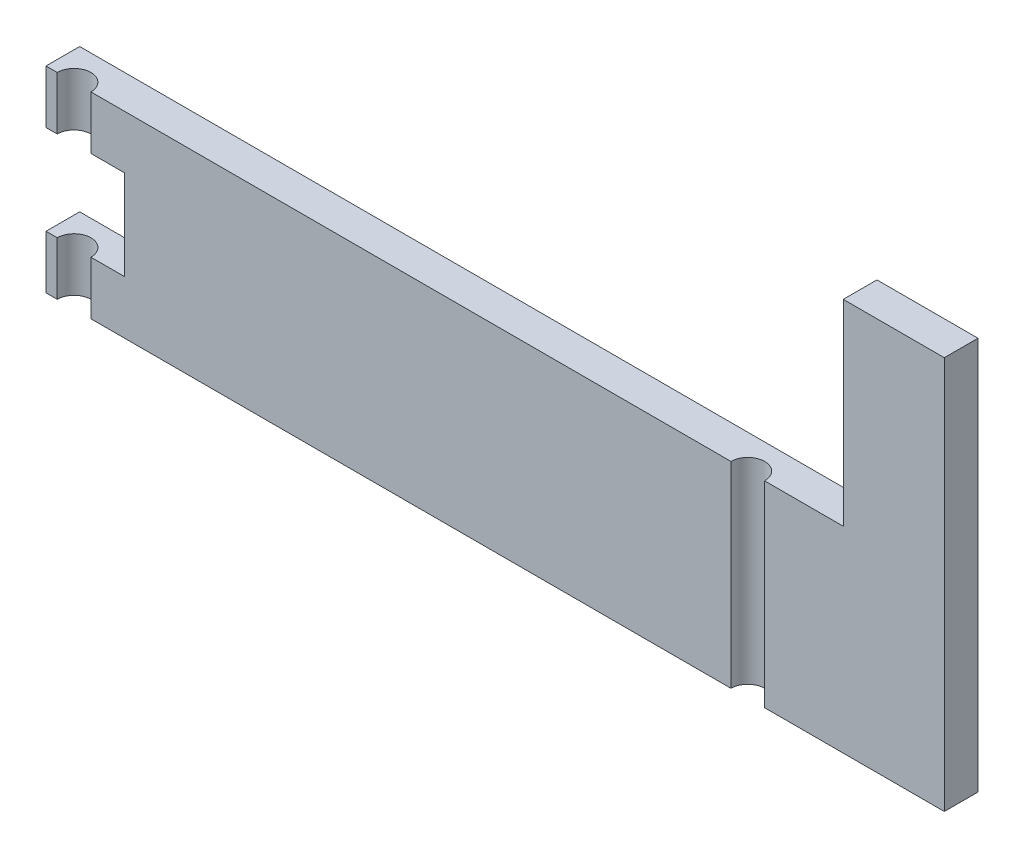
ISO-10303-21;
HEADER;
FILE_DESCRIPTION(('STEP AP214'),'2;1');
FILE_NAME('part.step','',(''),(''),'','','');
FILE_SCHEMA(('AUTOMOTIVE_DESIGN { 1 0 10303 214 1 1 1 1 }'));
ENDSEC;
DATA;
#1=APPLICATION_CONTEXT('core data for automotive mechanical design processes');
#2=APPLICATION_PROTOCOL_DEFINITION('international standard','automotive_design',2000,#1);
#3=PRODUCT_CONTEXT('',#1,'mechanical');
#4=PRODUCT('Part','Part','',(#3));
#5=PRODUCT_RELATED_PRODUCT_CATEGORY('part','',(#4));
#6=PRODUCT_DEFINITION_FORMATION('','',#4);
#7=PRODUCT_DEFINITION_CONTEXT('part definition',#1,'design');
#8=PRODUCT_DEFINITION('design','',#6,#7);
#9=PRODUCT_DEFINITION_SHAPE('','',#8);
#10=(LENGTH_UNIT() NAMED_UNIT(*) SI_UNIT(.MILLI.,.METRE.));
#11=(NAMED_UNIT(*) PLANE_ANGLE_UNIT() SI_UNIT($,.RADIAN.));
#12=(NAMED_UNIT(*) SI_UNIT($,.STERADIAN.) SOLID_ANGLE_UNIT());
#13=UNCERTAINTY_MEASURE_WITH_UNIT(LENGTH_MEASURE(1.E-05),#10,'distance_accuracy_value','');
#14=(GEOMETRIC_REPRESENTATION_CONTEXT(3) GLOBAL_UNCERTAINTY_ASSIGNED_CONTEXT((#13)) GLOBAL_UNIT_ASSIGNED_CONTEXT((#10,
#11,#12)) REPRESENTATION_CONTEXT('',''));
#15=CARTESIAN_POINT('',(0.,0.,0.));
#16=DIRECTION('',(0.,0.,1.));
#17=DIRECTION('',(1.,0.,0.));
#18=AXIS2_PLACEMENT_3D('',#15,#16,#17);
#19=CARTESIAN_POINT('',(155.,35.,6.));
#20=DIRECTION('',(0.,0.,1.));
#21=DIRECTION('',(1.,0.,0.));
#22=AXIS2_PLACEMENT_3D('',#19,#20,#21);
#23=PLANE('',#22);
#24=DIRECTION('',(0.,-1.,0.));
#25=VECTOR('',#24,1.);
#26=CARTESIAN_POINT('',(117.,70.,6.));
#27=LINE('',#26,#25);
#28=CARTESIAN_POINT('',(117.,35.,6.));
#29=VERTEX_POINT('',#28);
#30=CARTESIAN_POINT('',(117.,0.,6.));
#31=VERTEX_POINT('',#30);
#32=EDGE_CURVE('E11',#29,#31,#27,.T.);
#33=ORIENTED_EDGE('',*,*,#32,.F.);
#34=DIRECTION('',(-1.,0.,0.));
#35=VECTOR('',#34,1.);
#36=CARTESIAN_POINT('',(137.,35.,6.));
#37=LINE('',#36,#35);
#38=CARTESIAN_POINT('',(3.,35.,6.));
#39=VERTEX_POINT('',#38);
#40=EDGE_CURVE('E282',#29,#39,#37,.T.);
#41=ORIENTED_EDGE('',*,*,#40,.T.);
#42=DIRECTION('',(0.,-1.,0.));
#43=VECTOR('',#42,1.);
#44=CARTESIAN_POINT('',(3.,70.,6.));
#45=LINE('',#44,#43);
#46=CARTESIAN_POINT('',(3.,25.5,6.));
#47=VERTEX_POINT('',#46);
#48=EDGE_CURVE('E194',#47,#39,#45,.F.);
#49=ORIENTED_EDGE('',*,*,#48,.F.);
#50=DIRECTION('',(1.,0.,0.));
#51=VECTOR('',#50,1.);
#52=CARTESIAN_POINT('',(-4.99999999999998,25.5,6.));
#53=LINE('',#52,#51);
#54=CARTESIAN_POINT('',(8.99999999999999,25.5,6.));
#55=VERTEX_POINT('',#54);
#56=EDGE_CURVE('E216',#47,#55,#53,.T.);
#57=ORIENTED_EDGE('',*,*,#56,.T.);
#58=DIRECTION('',(0.,-1.,0.));
#59=VECTOR('',#58,1.);
#60=CARTESIAN_POINT('',(8.99999999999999,25.5,6.));
#61=LINE('',#60,#59);
#62=CARTESIAN_POINT('',(9.,9.50000000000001,6.));
#63=VERTEX_POINT('',#62);
#64=EDGE_CURVE('E222',#55,#63,#61,.T.);
#65=ORIENTED_EDGE('',*,*,#64,.T.);
#66=DIRECTION('',(-1.,0.,0.));
#67=VECTOR('',#66,1.);
#68=CARTESIAN_POINT('',(9.,9.50000000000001,6.));
#69=LINE('',#68,#67);
#70=CARTESIAN_POINT('',(3.,9.50000000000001,6.));
#71=VERTEX_POINT('',#70);
#72=EDGE_CURVE('E228',#63,#71,#69,.T.);
#73=ORIENTED_EDGE('',*,*,#72,.T.);
#74=CARTESIAN_POINT('',(3.,0.,6.));
#75=VERTEX_POINT('',#74);
#76=EDGE_CURVE('E156',#75,#71,#45,.F.);
#77=ORIENTED_EDGE('',*,*,#76,.F.);
#78=DIRECTION('',(1.,0.,0.));
#79=VECTOR('',#78,1.);
#80=CARTESIAN_POINT('',(-4.99999999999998,0.,6.));
#81=LINE('',#80,#79);
#82=EDGE_CURVE('E151',#75,#31,#81,.T.);
#83=ORIENTED_EDGE('',*,*,#82,.T.);
#84=EDGE_LOOP('',(#33,#41,#49,#57,#65,#73,#77,#83));
#85=FACE_BOUND('',#84,.T.);
#86=ADVANCED_FACE('F31',(#85),#23,.T.);
#87=DIRECTION('',(0.,-1.,0.));
#88=VECTOR('',#87,1.);
#89=CARTESIAN_POINT('',(-3.,70.,6.));
#90=LINE('',#89,#88);
#91=CARTESIAN_POINT('',(-3.,9.50000000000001,6.));
#92=VERTEX_POINT('',#91);
#93=CARTESIAN_POINT('',(-3.,0.,6.));
#94=VERTEX_POINT('',#93);
#95=EDGE_CURVE('E197',#92,#94,#90,.T.);
#96=ORIENTED_EDGE('',*,*,#95,.F.);
#97=CARTESIAN_POINT('',(-4.99999999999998,9.5,6.));
#98=VERTEX_POINT('',#97);
#99=EDGE_CURVE('E224',#92,#98,#69,.T.);
#100=ORIENTED_EDGE('',*,*,#99,.T.);
#101=DIRECTION('',(0.,-1.,0.));
#102=VECTOR('',#101,1.);
#103=CARTESIAN_POINT('',(-4.99999999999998,9.5,6.));
#104=LINE('',#103,#102);
#105=CARTESIAN_POINT('',(-4.99999999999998,0.,6.));
#106=VERTEX_POINT('',#105);
#107=EDGE_CURVE('E161',#98,#106,#104,.T.);
#108=ORIENTED_EDGE('',*,*,#107,.T.);
#109=EDGE_CURVE('E157',#106,#94,#81,.T.);
#110=ORIENTED_EDGE('',*,*,#109,.T.);
#111=EDGE_LOOP('',(#96,#100,#108,#110));
#112=FACE_BOUND('',#111,.T.);
#113=ADVANCED_FACE('F234',(#112),#23,.T.);
#114=CARTESIAN_POINT('',(-3.,35.,6.));
#115=VERTEX_POINT('',#114);
#116=CARTESIAN_POINT('',(-3.,25.5,6.));
#117=VERTEX_POINT('',#116);
#118=EDGE_CURVE('E198',#115,#117,#90,.T.);
#119=ORIENTED_EDGE('',*,*,#118,.F.);
#120=CARTESIAN_POINT('',(-4.99999999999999,35.,6.));
#121=VERTEX_POINT('',#120);
#122=EDGE_CURVE('E279',#115,#121,#37,.T.);
#123=ORIENTED_EDGE('',*,*,#122,.T.);
#124=DIRECTION('',(0.,-1.,0.));
#125=VECTOR('',#124,1.);
#126=CARTESIAN_POINT('',(-4.99999999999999,35.,6.));
#127=LINE('',#126,#125);
#128=CARTESIAN_POINT('',(-4.99999999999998,25.5,6.));
#129=VERTEX_POINT('',#128);
#130=EDGE_CURVE('E220',#121,#129,#127,.T.);
#131=ORIENTED_EDGE('',*,*,#130,.T.);
#132=EDGE_CURVE('E214',#129,#117,#53,.T.);
#133=ORIENTED_EDGE('',*,*,#132,.T.);
#134=EDGE_LOOP('',(#119,#123,#131,#133));
#135=FACE_BOUND('',#134,.T.);
#136=ADVANCED_FACE('F218',(#135),#23,.T.);
#137=CARTESIAN_POINT('',(155.,0.,6.));
#138=DIRECTION('',(-1.,0.,0.));
#139=DIRECTION('',(0.,-1.,0.));
#140=AXIS2_PLACEMENT_3D('',#137,#138,#139);
#141=PLANE('',#140);
#142=DIRECTION('',(0.,1.,0.));
#143=VECTOR('',#142,1.);
#144=CARTESIAN_POINT('',(155.,0.,0.));
#145=LINE('',#144,#143);
#146=CARTESIAN_POINT('',(155.,0.,0.));
#147=VERTEX_POINT('',#146);
#148=CARTESIAN_POINT('',(155.,70.,0.));
#149=VERTEX_POINT('',#148);
#150=EDGE_CURVE('E254',#147,#149,#145,.T.);
#151=ORIENTED_EDGE('',*,*,#150,.T.);
#152=DIRECTION('',(0.,0.,-1.));
#153=VECTOR('',#152,1.);
#154=CARTESIAN_POINT('',(155.,70.,6.));
#155=LINE('',#154,#153);
#156=CARTESIAN_POINT('',(155.,70.,6.));
#157=VERTEX_POINT('',#156);
#158=EDGE_CURVE('E191',#157,#149,#155,.T.);
#159=ORIENTED_EDGE('',*,*,#158,.F.);
#160=DIRECTION('',(0.,1.,0.));
#161=VECTOR('',#160,1.);
#162=CARTESIAN_POINT('',(155.,0.,6.));
#163=LINE('',#162,#161);
#164=CARTESIAN_POINT('',(155.,0.,6.));
#165=VERTEX_POINT('',#164);
#166=EDGE_CURVE('E273',#165,#157,#163,.T.);
#167=ORIENTED_EDGE('',*,*,#166,.F.);
#168=DIRECTION('',(0.,0.,-1.));
#169=VECTOR('',#168,1.);
#170=CARTESIAN_POINT('',(155.,0.,6.));
#171=LINE('',#170,#169);
#172=EDGE_CURVE('E160',#165,#147,#171,.T.);
#173=ORIENTED_EDGE('',*,*,#172,.T.);
#174=EDGE_LOOP('',(#151,#159,#167,#173));
#175=FACE_BOUND('',#174,.T.);
#176=ADVANCED_FACE('F33',(#175),#141,.F.);
#177=CARTESIAN_POINT('',(155.,70.,6.));
#178=DIRECTION('',(0.,-1.,0.));
#179=DIRECTION('',(0.,0.,-1.));
#180=AXIS2_PLACEMENT_3D('',#177,#178,#179);
#181=PLANE('',#180);
#182=DIRECTION('',(-1.,0.,0.));
#183=VECTOR('',#182,1.);
#184=CARTESIAN_POINT('',(155.,70.,0.));
#185=LINE('',#184,#183);
#186=CARTESIAN_POINT('',(137.,70.,0.));
#187=VERTEX_POINT('',#186);
#188=EDGE_CURVE('E257',#149,#187,#185,.T.);
#189=ORIENTED_EDGE('',*,*,#188,.T.);
#190=DIRECTION('',(0.,0.,-1.));
#191=VECTOR('',#190,1.);
#192=CARTESIAN_POINT('',(137.,70.,6.));
#193=LINE('',#192,#191);
#194=CARTESIAN_POINT('',(137.,70.,6.));
#195=VERTEX_POINT('',#194);
#196=EDGE_CURVE('E188',#195,#187,#193,.T.);
#197=ORIENTED_EDGE('',*,*,#196,.F.);
#198=DIRECTION('',(-1.,0.,0.));
#199=VECTOR('',#198,1.);
#200=CARTESIAN_POINT('',(155.,70.,6.));
#201=LINE('',#200,#199);
#202=EDGE_CURVE('E276',#157,#195,#201,.T.);
#203=ORIENTED_EDGE('',*,*,#202,.F.);
#204=ORIENTED_EDGE('',*,*,#158,.T.);
#205=EDGE_LOOP('',(#189,#197,#203,#204));
#206=FACE_BOUND('',#205,.T.);
#207=ADVANCED_FACE('F327',(#206),#181,.F.);
#208=CARTESIAN_POINT('',(137.,70.,6.));
#209=DIRECTION('',(1.,0.,0.));
#210=DIRECTION('',(0.,1.,0.));
#211=AXIS2_PLACEMENT_3D('',#208,#209,#210);
#212=PLANE('',#211);
#213=DIRECTION('',(0.,-1.,0.));
#214=VECTOR('',#213,1.);
#215=CARTESIAN_POINT('',(137.,70.,0.));
#216=LINE('',#215,#214);
#217=CARTESIAN_POINT('',(137.,35.,0.));
#218=VERTEX_POINT('',#217);
#219=EDGE_CURVE('E259',#187,#218,#216,.T.);
#220=ORIENTED_EDGE('',*,*,#219,.T.);
#221=DIRECTION('',(0.,0.,-1.));
#222=VECTOR('',#221,1.);
#223=CARTESIAN_POINT('',(137.,35.,6.));
#224=LINE('',#223,#222);
#225=CARTESIAN_POINT('',(137.,35.,6.));
#226=VERTEX_POINT('',#225);
#227=EDGE_CURVE('E185',#226,#218,#224,.T.);
#228=ORIENTED_EDGE('',*,*,#227,.F.);
#229=DIRECTION('',(0.,-1.,0.));
#230=VECTOR('',#229,1.);
#231=CARTESIAN_POINT('',(137.,70.,6.));
#232=LINE('',#231,#230);
#233=EDGE_CURVE('E278',#195,#226,#232,.T.);
#234=ORIENTED_EDGE('',*,*,#233,.F.);
#235=ORIENTED_EDGE('',*,*,#196,.T.);
#236=EDGE_LOOP('',(#220,#228,#234,#235));
#237=FACE_BOUND('',#236,.T.);
#238=ADVANCED_FACE('F332',(#237),#212,.F.);
#239=CARTESIAN_POINT('',(137.,35.,6.));
#240=DIRECTION('',(0.,-1.,0.));
#241=DIRECTION('',(1.,0.,0.));
#242=AXIS2_PLACEMENT_3D('',#239,#240,#241);
#243=PLANE('',#242);
#244=ORIENTED_EDGE('',*,*,#40,.F.);
#245=CARTESIAN_POINT('',(120.,35.,6.));
#246=DIRECTION('',(0.,-1.,0.));
#247=DIRECTION('',(1.,0.,0.));
#248=AXIS2_PLACEMENT_3D('',#245,#246,#247);
#249=CIRCLE('',#248,3.00000000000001);
#250=CARTESIAN_POINT('',(123.,35.,6.));
#251=VERTEX_POINT('',#250);
#252=EDGE_CURVE('E143',#29,#251,#249,.T.);
#253=ORIENTED_EDGE('',*,*,#252,.T.);
#254=EDGE_CURVE('E280',#226,#251,#37,.T.);
#255=ORIENTED_EDGE('',*,*,#254,.F.);
#256=ORIENTED_EDGE('',*,*,#227,.T.);
#257=DIRECTION('',(-1.,0.,0.));
#258=VECTOR('',#257,1.);
#259=CARTESIAN_POINT('',(137.,35.,0.));
#260=LINE('',#259,#258);
#261=CARTESIAN_POINT('',(-4.99999999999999,35.,0.));
#262=VERTEX_POINT('',#261);
#263=EDGE_CURVE('E261',#218,#262,#260,.T.);
#264=ORIENTED_EDGE('',*,*,#263,.T.);
#265=DIRECTION('',(0.,0.,-1.));
#266=VECTOR('',#265,1.);
#267=CARTESIAN_POINT('',(-4.99999999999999,35.,6.));
#268=LINE('',#267,#266);
#269=EDGE_CURVE('E182',#121,#262,#268,.T.);
#270=ORIENTED_EDGE('',*,*,#269,.F.);
#271=ORIENTED_EDGE('',*,*,#122,.F.);
#272=CARTESIAN_POINT('',(0.,35.,6.));
#273=DIRECTION('',(0.,-1.,0.));
#274=DIRECTION('',(1.,0.,0.));
#275=AXIS2_PLACEMENT_3D('',#272,#273,#274);
#276=CIRCLE('',#275,3.);
#277=EDGE_CURVE('E206',#115,#39,#276,.T.);
#278=ORIENTED_EDGE('',*,*,#277,.T.);
#279=EDGE_LOOP('',(#244,#253,#255,#256,#264,#270,#271,#278));
#280=FACE_BOUND('',#279,.T.);
#281=ADVANCED_FACE('F287',(#280),#243,.F.);
#282=CARTESIAN_POINT('',(-4.99999999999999,35.,6.));
#283=DIRECTION('',(1.,0.,0.));
#284=DIRECTION('',(0.,1.,0.));
#285=AXIS2_PLACEMENT_3D('',#282,#283,#284);
#286=PLANE('',#285);
#287=DIRECTION('',(0.,-1.,0.));
#288=VECTOR('',#287,1.);
#289=CARTESIAN_POINT('',(-4.99999999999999,35.,0.));
#290=LINE('',#289,#288);
#291=CARTESIAN_POINT('',(-4.99999999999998,25.5,0.));
#292=VERTEX_POINT('',#291);
#293=EDGE_CURVE('E263',#262,#292,#290,.T.);
#294=ORIENTED_EDGE('',*,*,#293,.T.);
#295=DIRECTION('',(0.,0.,-1.));
#296=VECTOR('',#295,1.);
#297=CARTESIAN_POINT('',(-4.99999999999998,25.5,6.));
#298=LINE('',#297,#296);
#299=EDGE_CURVE('E179',#129,#292,#298,.T.);
#300=ORIENTED_EDGE('',*,*,#299,.F.);
#301=ORIENTED_EDGE('',*,*,#130,.F.);
#302=ORIENTED_EDGE('',*,*,#269,.T.);
#303=EDGE_LOOP('',(#294,#300,#301,#302));
#304=FACE_BOUND('',#303,.T.);
#305=ADVANCED_FACE('F291',(#304),#286,.F.);
#306=CARTESIAN_POINT('',(-4.99999999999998,25.5,6.));
#307=DIRECTION('',(0.,1.,0.));
#308=DIRECTION('',(0.,0.,1.));
#309=AXIS2_PLACEMENT_3D('',#306,#307,#308);
#310=PLANE('',#309);
#311=ORIENTED_EDGE('',*,*,#56,.F.);
#312=CARTESIAN_POINT('',(0.,25.5,6.));
#313=DIRECTION('',(0.,1.,0.));
#314=DIRECTION('',(0.,0.,1.));
#315=AXIS2_PLACEMENT_3D('',#312,#313,#314);
#316=CIRCLE('',#315,3.);
#317=EDGE_CURVE('E203',#47,#117,#316,.T.);
#318=ORIENTED_EDGE('',*,*,#317,.T.);
#319=ORIENTED_EDGE('',*,*,#132,.F.);
#320=ORIENTED_EDGE('',*,*,#299,.T.);
#321=DIRECTION('',(1.,0.,0.));
#322=VECTOR('',#321,1.);
#323=CARTESIAN_POINT('',(-4.99999999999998,25.5,0.));
#324=LINE('',#323,#322);
#325=CARTESIAN_POINT('',(8.99999999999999,25.5,0.));
#326=VERTEX_POINT('',#325);
#327=EDGE_CURVE('E265',#292,#326,#324,.T.);
#328=ORIENTED_EDGE('',*,*,#327,.T.);
#329=DIRECTION('',(0.,0.,-1.));
#330=VECTOR('',#329,1.);
#331=CARTESIAN_POINT('',(8.99999999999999,25.5,6.));
#332=LINE('',#331,#330);
#333=EDGE_CURVE('E176',#55,#326,#332,.T.);
#334=ORIENTED_EDGE('',*,*,#333,.F.);
#335=EDGE_LOOP('',(#311,#318,#319,#320,#328,#334));
#336=FACE_BOUND('',#335,.T.);
#337=ADVANCED_FACE('F213',(#336),#310,.F.);
#338=CARTESIAN_POINT('',(8.99999999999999,25.5,6.));
#339=DIRECTION('',(1.,0.,0.));
#340=DIRECTION('',(0.,1.,0.));
#341=AXIS2_PLACEMENT_3D('',#338,#339,#340);
#342=PLANE('',#341);
#343=DIRECTION('',(0.,-1.,0.));
#344=VECTOR('',#343,1.);
#345=CARTESIAN_POINT('',(8.99999999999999,25.5,0.));
#346=LINE('',#345,#344);
#347=CARTESIAN_POINT('',(9.,9.50000000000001,0.));
#348=VERTEX_POINT('',#347);
#349=EDGE_CURVE('E267',#326,#348,#346,.T.);
#350=ORIENTED_EDGE('',*,*,#349,.T.);
#351=DIRECTION('',(0.,0.,-1.));
#352=VECTOR('',#351,1.);
#353=CARTESIAN_POINT('',(9.,9.50000000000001,6.));
#354=LINE('',#353,#352);
#355=EDGE_CURVE('E173',#63,#348,#354,.T.);
#356=ORIENTED_EDGE('',*,*,#355,.F.);
#357=ORIENTED_EDGE('',*,*,#64,.F.);
#358=ORIENTED_EDGE('',*,*,#333,.T.);
#359=EDGE_LOOP('',(#350,#356,#357,#358));
#360=FACE_BOUND('',#359,.T.);
#361=ADVANCED_FACE('F299',(#360),#342,.F.);
#362=CARTESIAN_POINT('',(9.,9.50000000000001,6.));
#363=DIRECTION('',(0.,-1.,0.));
#364=DIRECTION('',(1.,0.,0.));
#365=AXIS2_PLACEMENT_3D('',#362,#363,#364);
#366=PLANE('',#365);
#367=ORIENTED_EDGE('',*,*,#99,.F.);
#368=CARTESIAN_POINT('',(0.,9.50000000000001,6.));
#369=DIRECTION('',(0.,-1.,0.));
#370=DIRECTION('',(1.,0.,0.));
#371=AXIS2_PLACEMENT_3D('',#368,#369,#370);
#372=CIRCLE('',#371,3.);
#373=EDGE_CURVE('E252',#92,#71,#372,.T.);
#374=ORIENTED_EDGE('',*,*,#373,.T.);
#375=ORIENTED_EDGE('',*,*,#72,.F.);
#376=ORIENTED_EDGE('',*,*,#355,.T.);
#377=DIRECTION('',(-1.,0.,0.));
#378=VECTOR('',#377,1.);
#379=CARTESIAN_POINT('',(9.,9.50000000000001,0.));
#380=LINE('',#379,#378);
#381=CARTESIAN_POINT('',(-4.99999999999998,9.5,0.));
#382=VERTEX_POINT('',#381);
#383=EDGE_CURVE('E241',#348,#382,#380,.T.);
#384=ORIENTED_EDGE('',*,*,#383,.T.);
#385=DIRECTION('',(0.,0.,-1.));
#386=VECTOR('',#385,1.);
#387=CARTESIAN_POINT('',(-4.99999999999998,9.5,6.));
#388=LINE('',#387,#386);
#389=EDGE_CURVE('E170',#98,#382,#388,.T.);
#390=ORIENTED_EDGE('',*,*,#389,.F.);
#391=EDGE_LOOP('',(#367,#374,#375,#376,#384,#390));
#392=FACE_BOUND('',#391,.T.);
#393=ADVANCED_FACE('F239',(#392),#366,.F.);
#394=CARTESIAN_POINT('',(-4.99999999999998,9.5,6.));
#395=DIRECTION('',(1.,0.,0.));
#396=DIRECTION('',(0.,1.,0.));
#397=AXIS2_PLACEMENT_3D('',#394,#395,#396);
#398=PLANE('',#397);
#399=DIRECTION('',(0.,-1.,0.));
#400=VECTOR('',#399,1.);
#401=CARTESIAN_POINT('',(-4.99999999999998,9.5,0.));
#402=LINE('',#401,#400);
#403=CARTESIAN_POINT('',(-4.99999999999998,0.,0.));
#404=VERTEX_POINT('',#403);
#405=EDGE_CURVE('E246',#382,#404,#402,.T.);
#406=ORIENTED_EDGE('',*,*,#405,.T.);
#407=DIRECTION('',(0.,0.,-1.));
#408=VECTOR('',#407,1.);
#409=CARTESIAN_POINT('',(-4.99999999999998,0.,6.));
#410=LINE('',#409,#408);
#411=EDGE_CURVE('E167',#106,#404,#410,.T.);
#412=ORIENTED_EDGE('',*,*,#411,.F.);
#413=ORIENTED_EDGE('',*,*,#107,.F.);
#414=ORIENTED_EDGE('',*,*,#389,.T.);
#415=EDGE_LOOP('',(#406,#412,#413,#414));
#416=FACE_BOUND('',#415,.T.);
#417=ADVANCED_FACE('F244',(#416),#398,.F.);
#418=CARTESIAN_POINT('',(-4.99999999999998,0.,6.));
#419=DIRECTION('',(0.,1.,0.));
#420=DIRECTION('',(0.,0.,1.));
#421=AXIS2_PLACEMENT_3D('',#418,#419,#420);
#422=PLANE('',#421);
#423=CARTESIAN_POINT('',(123.,0.,6.));
#424=VERTEX_POINT('',#423);
#425=EDGE_CURVE('E153',#424,#165,#81,.T.);
#426=ORIENTED_EDGE('',*,*,#425,.F.);
#427=CARTESIAN_POINT('',(120.,0.,6.));
#428=DIRECTION('',(0.,-1.,0.));
#429=DIRECTION('',(0.,0.,-1.));
#430=AXIS2_PLACEMENT_3D('',#427,#428,#429);
#431=CIRCLE('',#430,3.00000000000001);
#432=EDGE_CURVE('E45',#31,#424,#431,.T.);
#433=ORIENTED_EDGE('',*,*,#432,.F.);
#434=ORIENTED_EDGE('',*,*,#82,.F.);
#435=CARTESIAN_POINT('',(0.,0.,6.));
#436=DIRECTION('',(0.,-1.,0.));
#437=DIRECTION('',(0.,0.,-1.));
#438=AXIS2_PLACEMENT_3D('',#435,#436,#437);
#439=CIRCLE('',#438,3.);
#440=EDGE_CURVE('E53',#94,#75,#439,.T.);
#441=ORIENTED_EDGE('',*,*,#440,.F.);
#442=ORIENTED_EDGE('',*,*,#109,.F.);
#443=ORIENTED_EDGE('',*,*,#411,.T.);
#444=DIRECTION('',(1.,0.,0.));
#445=VECTOR('',#444,1.);
#446=CARTESIAN_POINT('',(-4.99999999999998,0.,0.));
#447=LINE('',#446,#445);
#448=EDGE_CURVE('E271',#404,#147,#447,.T.);
#449=ORIENTED_EDGE('',*,*,#448,.T.);
#450=ORIENTED_EDGE('',*,*,#172,.F.);
#451=EDGE_LOOP('',(#426,#433,#434,#441,#442,#443,#449,#450));
#452=FACE_BOUND('',#451,.T.);
#453=ADVANCED_FACE('F150',(#452),#422,.F.);
#454=DIRECTION('',(0.,-1.,0.));
#455=VECTOR('',#454,1.);
#456=CARTESIAN_POINT('',(123.,70.,6.));
#457=LINE('',#456,#455);
#458=EDGE_CURVE('E39',#424,#251,#457,.F.);
#459=ORIENTED_EDGE('',*,*,#458,.F.);
#460=ORIENTED_EDGE('',*,*,#425,.T.);
#461=ORIENTED_EDGE('',*,*,#166,.T.);
#462=ORIENTED_EDGE('',*,*,#202,.T.);
#463=ORIENTED_EDGE('',*,*,#233,.T.);
#464=ORIENTED_EDGE('',*,*,#254,.T.);
#465=EDGE_LOOP('',(#459,#460,#461,#462,#463,#464));
#466=FACE_BOUND('',#465,.T.);
#467=ADVANCED_FACE('F312',(#466),#23,.T.);
#468=CARTESIAN_POINT('',(155.,35.,0.));
#469=DIRECTION('',(0.,0.,1.));
#470=DIRECTION('',(1.,0.,0.));
#471=AXIS2_PLACEMENT_3D('',#468,#469,#470);
#472=PLANE('',#471);
#473=ORIENTED_EDGE('',*,*,#150,.F.);
#474=ORIENTED_EDGE('',*,*,#448,.F.);
#475=ORIENTED_EDGE('',*,*,#405,.F.);
#476=ORIENTED_EDGE('',*,*,#383,.F.);
#477=ORIENTED_EDGE('',*,*,#349,.F.);
#478=ORIENTED_EDGE('',*,*,#327,.F.);
#479=ORIENTED_EDGE('',*,*,#293,.F.);
#480=ORIENTED_EDGE('',*,*,#263,.F.);
#481=ORIENTED_EDGE('',*,*,#219,.F.);
#482=ORIENTED_EDGE('',*,*,#188,.F.);
#483=EDGE_LOOP('',(#473,#474,#475,#476,#477,#478,#479,#480,#481,#482));
#484=FACE_BOUND('',#483,.T.);
#485=ADVANCED_FACE('F296',(#484),#472,.F.);
#486=CARTESIAN_POINT('',(0.,70.,6.));
#487=DIRECTION('',(0.,-1.,0.));
#488=DIRECTION('',(0.,0.,-1.));
#489=AXIS2_PLACEMENT_3D('',#486,#487,#488);
#490=CYLINDRICAL_SURFACE('',#489,3.);
#491=ORIENTED_EDGE('',*,*,#118,.T.);
#492=ORIENTED_EDGE('',*,*,#317,.F.);
#493=ORIENTED_EDGE('',*,*,#48,.T.);
#494=ORIENTED_EDGE('',*,*,#277,.F.);
#495=EDGE_LOOP('',(#491,#492,#493,#494));
#496=FACE_BOUND('',#495,.T.);
#497=ADVANCED_FACE('F202',(#496),#490,.F.);
#498=ORIENTED_EDGE('',*,*,#95,.T.);
#499=ORIENTED_EDGE('',*,*,#440,.T.);
#500=ORIENTED_EDGE('',*,*,#76,.T.);
#501=ORIENTED_EDGE('',*,*,#373,.F.);
#502=EDGE_LOOP('',(#498,#499,#500,#501));
#503=FACE_BOUND('',#502,.T.);
#504=ADVANCED_FACE('F301',(#503),#490,.F.);
#505=CARTESIAN_POINT('',(120.,70.,6.));
#506=DIRECTION('',(0.,-1.,0.));
#507=DIRECTION('',(0.,0.,-1.));
#508=AXIS2_PLACEMENT_3D('',#505,#506,#507);
#509=CYLINDRICAL_SURFACE('',#508,3.00000000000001);
#510=ORIENTED_EDGE('',*,*,#32,.T.);
#511=ORIENTED_EDGE('',*,*,#432,.T.);
#512=ORIENTED_EDGE('',*,*,#458,.T.);
#513=ORIENTED_EDGE('',*,*,#252,.F.);
#514=EDGE_LOOP('',(#510,#511,#512,#513));
#515=FACE_BOUND('',#514,.T.);
#516=ADVANCED_FACE('F141',(#515),#509,.F.);
#517=CLOSED_SHELL('',(#86,#113,#136,#176,#207,#238,#281,#305,#337,#361,#393,#417,#453,#467,#485,
#497,#504,#516));
#518=MANIFOLD_SOLID_BREP('B2',#517);
#519=ADVANCED_BREP_SHAPE_REPRESENTATION('',(#18,#518),#14);
#520=SHAPE_DEFINITION_REPRESENTATION(#9,#519);
ENDSEC;
END-ISO-10303-21;
